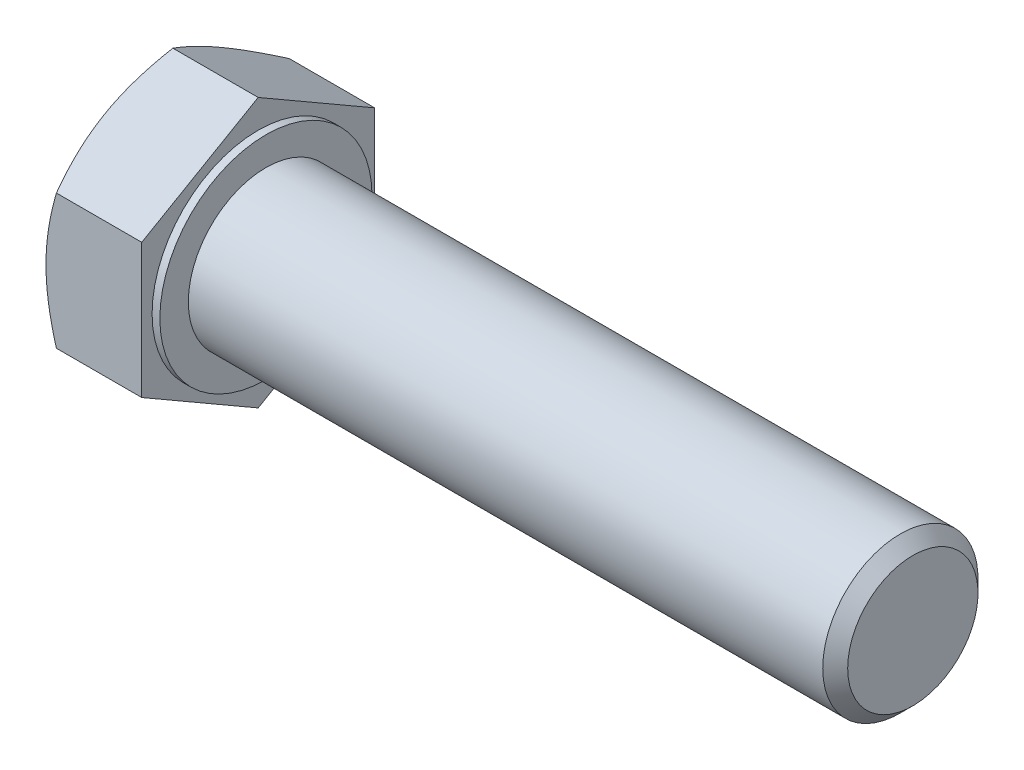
from build123d import *

# Parameters (mm, degrees)
BASEHEAD_DEPTH = 8
BEARINGSKE_W   = 0.6
BEARINGSKE_H   = 2.192304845


with BuildPart() as part:
    # HeadSke → BaseHead (new body)
    with BuildSketch(Plane(origin=(0, 0, 0), x_dir=(0, 0, -1), z_dir=(1, 0, 0))):
        Polygon((9, 5.196152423), (9, -5.196152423), (0, -10.392304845), (-9, -5.196152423), (-9, 5.196152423), (0, 10.392304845), align=None)
    extrude(amount=BASEHEAD_DEPTH)

    # BodySke → BaseBody (revolve)
    with BuildSketch(Plane.XY, mode=Mode.PRIVATE) as basebody_sk:
        Polygon((0, 0), (58, 0), (58, 5.036), (57.036, 6), (0, 6), align=None)
    revolve(basebody_sk.sketch.rotate(Axis((0, 0, 0), (1, 0, 0)), 90), axis=Axis((0, 0, 0), (1, 0, 0)))

    # Sketch3 → HeadChamfer (revolve, cut)
    with BuildSketch(Plane(origin=(0, 0, 0), x_dir=(1, 0, 0), z_dir=(0, 1, 0))):
        Polygon((2.25, 12.897114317), (-2.25, 5.102885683), (-14.304766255, 12.062708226), (-9.804766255, 19.85693686), align=None)
    revolve(axis=Axis((0, 0, 0), (1, 0, 0)), mode=Mode.SUBTRACT)

    # BearingSke → BearingFace (revolve, cut)
    with BuildSketch(Plane.XY, mode=Mode.PRIVATE) as bearingface_sk:
        with Locations((7.7, 9.296152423)):
            Rectangle(BEARINGSKE_W, BEARINGSKE_H)
    revolve(bearingface_sk.sketch.rotate(Axis((0, 0, 0), (1, 0, 0)), 90), axis=Axis((0, 0, 0), (1, 0, 0)), mode=Mode.SUBTRACT)


solid = part.part
